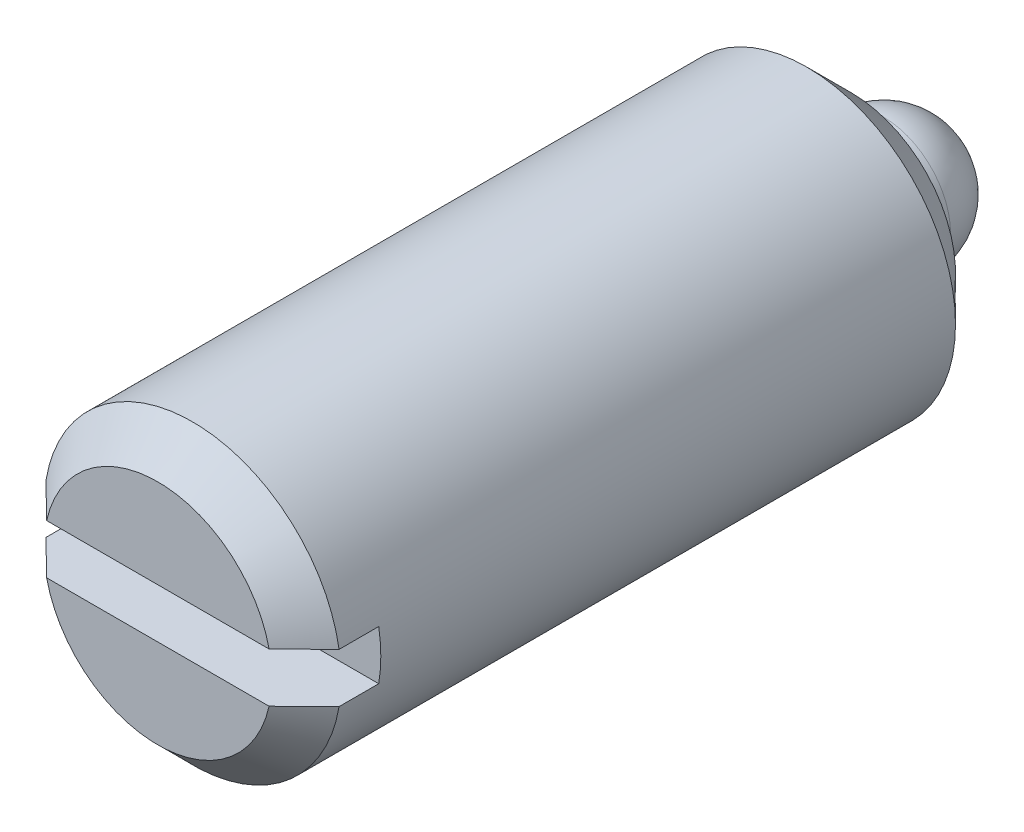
ISO-10303-21;
HEADER;
FILE_DESCRIPTION(('STEP AP214'),'2;1');
FILE_NAME('part.step','',(''),(''),'','','');
FILE_SCHEMA(('AUTOMOTIVE_DESIGN { 1 0 10303 214 1 1 1 1 }'));
ENDSEC;
DATA;
#1=APPLICATION_CONTEXT('core data for automotive mechanical design processes');
#2=APPLICATION_PROTOCOL_DEFINITION('international standard','automotive_design',2000,#1);
#3=PRODUCT_CONTEXT('',#1,'mechanical');
#4=PRODUCT('Part','Part','',(#3));
#5=PRODUCT_RELATED_PRODUCT_CATEGORY('part','',(#4));
#6=PRODUCT_DEFINITION_FORMATION('','',#4);
#7=PRODUCT_DEFINITION_CONTEXT('part definition',#1,'design');
#8=PRODUCT_DEFINITION('design','',#6,#7);
#9=PRODUCT_DEFINITION_SHAPE('','',#8);
#10=(LENGTH_UNIT() NAMED_UNIT(*) SI_UNIT(.MILLI.,.METRE.));
#11=(NAMED_UNIT(*) PLANE_ANGLE_UNIT() SI_UNIT($,.RADIAN.));
#12=(NAMED_UNIT(*) SI_UNIT($,.STERADIAN.) SOLID_ANGLE_UNIT());
#13=UNCERTAINTY_MEASURE_WITH_UNIT(LENGTH_MEASURE(1.E-05),#10,'distance_accuracy_value','');
#14=(GEOMETRIC_REPRESENTATION_CONTEXT(3) GLOBAL_UNCERTAINTY_ASSIGNED_CONTEXT((#13)) GLOBAL_UNIT_ASSIGNED_CONTEXT((#10,
#11,#12)) REPRESENTATION_CONTEXT('',''));
#15=CARTESIAN_POINT('',(0.,0.,0.));
#16=DIRECTION('',(0.,0.,1.));
#17=DIRECTION('',(1.,0.,0.));
#18=AXIS2_PLACEMENT_3D('',#15,#16,#17);
#19=CARTESIAN_POINT('',(1.95972957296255,0.500000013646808,16.));
#20=DIRECTION('',(0.,0.,-1.));
#21=DIRECTION('',(-1.,-7.49125187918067E-11,0.));
#22=AXIS2_PLACEMENT_3D('',#19,#20,#21);
#23=PLANE('',#22);
#24=DIRECTION('',(-1.,-7.49125187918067E-11,0.));
#25=VECTOR('',#24,1.);
#26=CARTESIAN_POINT('',(3.74562556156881E-11,-0.4999999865,16.));
#27=LINE('',#26,#25);
#28=CARTESIAN_POINT('',(2.2449944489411,-0.499999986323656,16.));
#29=VERTEX_POINT('',#28);
#30=CARTESIAN_POINT('',(-2.24499444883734,-0.499999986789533,16.));
#31=VERTEX_POINT('',#30);
#32=EDGE_CURVE('E116',#29,#31,#27,.T.);
#33=ORIENTED_EDGE('',*,*,#32,.T.);
#34=CARTESIAN_POINT('',(0.,0.,16.));
#35=DIRECTION('',(0.,0.,-1.));
#36=DIRECTION('',(-7.49125187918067E-11,1.,0.));
#37=AXIS2_PLACEMENT_3D('',#34,#35,#36);
#38=CIRCLE('',#37,2.30000001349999);
#39=EDGE_CURVE('E98',#29,#31,#38,.T.);
#40=ORIENTED_EDGE('',*,*,#39,.F.);
#41=EDGE_LOOP('',(#33,#40));
#42=FACE_BOUND('',#41,.T.);
#43=ADVANCED_FACE('F14',(#42),#23,.F.);
#44=DIRECTION('',(1.,7.49125187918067E-11,0.));
#45=VECTOR('',#44,1.);
#46=CARTESIAN_POINT('',(-3.74562631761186E-11,0.5000000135,16.));
#47=LINE('',#46,#45);
#48=CARTESIAN_POINT('',(-2.24499444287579,0.500000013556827,16.));
#49=VERTEX_POINT('',#48);
#50=CARTESIAN_POINT('',(2.24499444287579,0.500000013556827,16.));
#51=VERTEX_POINT('',#50);
#52=EDGE_CURVE('E91',#49,#51,#47,.T.);
#53=ORIENTED_EDGE('',*,*,#52,.T.);
#54=EDGE_CURVE('E101',#49,#51,#38,.T.);
#55=ORIENTED_EDGE('',*,*,#54,.F.);
#56=EDGE_LOOP('',(#53,#55));
#57=FACE_BOUND('',#56,.T.);
#58=ADVANCED_FACE('F138',(#57),#23,.F.);
#59=CARTESIAN_POINT('',(0.,1.35E-08,2.9));
#60=DIRECTION('',(0.,0.,1.));
#61=DIRECTION('',(-7.49125187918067E-11,1.,0.));
#62=AXIS2_PLACEMENT_3D('',#59,#60,#61);
#63=CYLINDRICAL_SURFACE('',#62,3.);
#64=CARTESIAN_POINT('',(0.,1.35E-08,2.9));
#65=DIRECTION('',(0.,0.,1.));
#66=DIRECTION('',(1.,7.49125187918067E-11,0.));
#67=AXIS2_PLACEMENT_3D('',#64,#65,#66);
#68=CIRCLE('',#67,3.);
#69=CARTESIAN_POINT('',(3.,1.37247375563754E-08,2.9));
#70=VERTEX_POINT('',#69);
#71=EDGE_CURVE('E87',#70,#70,#68,.T.);
#72=ORIENTED_EDGE('',*,*,#71,.T.);
#73=EDGE_LOOP('',(#72));
#74=FACE_BOUND('',#73,.T.);
#75=CARTESIAN_POINT('',(0.,0.,15.3));
#76=DIRECTION('',(0.,0.,-1.));
#77=DIRECTION('',(-7.49125187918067E-11,1.,0.));
#78=AXIS2_PLACEMENT_3D('',#75,#76,#77);
#79=CIRCLE('',#78,3.00000001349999);
#80=CARTESIAN_POINT('',(2.95803989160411,-0.499999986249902,15.3000000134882));
#81=VERTEX_POINT('',#80);
#82=CARTESIAN_POINT('',(-2.95803990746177,-0.499999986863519,15.3));
#83=VERTEX_POINT('',#82);
#84=EDGE_CURVE('E97',#81,#83,#79,.T.);
#85=ORIENTED_EDGE('',*,*,#84,.T.);
#86=DIRECTION('',(0.,0.,-1.));
#87=VECTOR('',#86,1.);
#88=CARTESIAN_POINT('',(-2.9580398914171,-0.499999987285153,8.95));
#89=LINE('',#88,#87);
#90=CARTESIAN_POINT('',(-2.95803989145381,-0.499999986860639,14.5));
#91=VERTEX_POINT('',#90);
#92=EDGE_CURVE('E35',#83,#91,#89,.T.);
#93=ORIENTED_EDGE('',*,*,#92,.T.);
#94=CARTESIAN_POINT('',(0.,1.34999966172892E-08,14.5));
#95=DIRECTION('',(0.,0.,1.));
#96=DIRECTION('',(7.49125187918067E-11,-1.,0.));
#97=AXIS2_PLACEMENT_3D('',#94,#95,#96);
#98=CIRCLE('',#97,2.99999999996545);
#99=CARTESIAN_POINT('',(-2.95803989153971,0.500000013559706,14.5));
#100=VERTEX_POINT('',#99);
#101=EDGE_CURVE('E85',#100,#91,#98,.T.);
#102=ORIENTED_EDGE('',*,*,#101,.F.);
#103=DIRECTION('',(0.,0.,1.));
#104=VECTOR('',#103,1.);
#105=CARTESIAN_POINT('',(-2.95803989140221,0.500000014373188,8.95));
#106=LINE('',#105,#104);
#107=CARTESIAN_POINT('',(-2.95803989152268,0.500000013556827,15.3000000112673));
#108=VERTEX_POINT('',#107);
#109=EDGE_CURVE('E78',#100,#108,#106,.T.);
#110=ORIENTED_EDGE('',*,*,#109,.T.);
#111=CARTESIAN_POINT('',(2.95803990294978,0.500000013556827,15.3));
#112=VERTEX_POINT('',#111);
#113=EDGE_CURVE('E83',#108,#112,#79,.T.);
#114=ORIENTED_EDGE('',*,*,#113,.T.);
#115=DIRECTION('',(0.,0.,-1.));
#116=VECTOR('',#115,1.);
#117=CARTESIAN_POINT('',(2.9580398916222,0.500000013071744,8.95));
#118=LINE('',#117,#116);
#119=CARTESIAN_POINT('',(2.95803989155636,0.500000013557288,14.5));
#120=VERTEX_POINT('',#119);
#121=EDGE_CURVE('E43',#112,#120,#118,.T.);
#122=ORIENTED_EDGE('',*,*,#121,.T.);
#123=CARTESIAN_POINT('',(0.,1.34999966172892E-08,14.5));
#124=DIRECTION('',(0.,0.,1.));
#125=DIRECTION('',(7.49125187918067E-11,-1.,0.));
#126=AXIS2_PLACEMENT_3D('',#123,#124,#125);
#127=CIRCLE('',#126,3.00000000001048);
#128=CARTESIAN_POINT('',(2.95803989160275,-0.499999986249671,14.5));
#129=VERTEX_POINT('',#128);
#130=EDGE_CURVE('E108',#129,#120,#127,.T.);
#131=ORIENTED_EDGE('',*,*,#130,.F.);
#132=DIRECTION('',(0.,0.,1.));
#133=VECTOR('',#132,1.);
#134=CARTESIAN_POINT('',(2.95803989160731,-0.499999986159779,8.95));
#135=LINE('',#134,#133);
#136=EDGE_CURVE('E234',#129,#81,#135,.T.);
#137=ORIENTED_EDGE('',*,*,#136,.T.);
#138=EDGE_LOOP('',(#85,#93,#102,#110,#114,#122,#131,#137));
#139=FACE_BOUND('',#138,.T.);
#140=ADVANCED_FACE('F81',(#74,#139),#63,.T.);
#141=CARTESIAN_POINT('',(0.,0.,15.3));
#142=DIRECTION('',(0.,0.,-1.));
#143=DIRECTION('',(-7.49125187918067E-11,1.,0.));
#144=AXIS2_PLACEMENT_3D('',#141,#142,#143);
#145=CONICAL_SURFACE('',#144,3.00000001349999,0.785398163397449);
#146=ORIENTED_EDGE('',*,*,#84,.F.);
#147=CARTESIAN_POINT('',(6.53264893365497,-0.499999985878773,11.748244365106));
#148=CARTESIAN_POINT('',(6.30108594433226,-0.499999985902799,11.9791261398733));
#149=CARTESIAN_POINT('',(6.06949276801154,-0.499999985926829,12.2099776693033));
#150=CARTESIAN_POINT('',(5.60619628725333,-0.4999999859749,12.6715875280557));
#151=CARTESIAN_POINT('',(5.37449297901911,-0.499999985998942,12.9023458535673));
#152=CARTESIAN_POINT('',(4.91073296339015,-0.499999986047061,13.363929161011));
#153=CARTESIAN_POINT('',(4.67867612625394,-0.499999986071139,13.594754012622));
#154=CARTESIAN_POINT('',(4.21434980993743,-0.499999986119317,14.0561728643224));
#155=CARTESIAN_POINT('',(3.98208033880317,-0.499999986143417,14.2867668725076));
#156=CARTESIAN_POINT('',(3.52760075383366,-0.499999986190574,14.7372639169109));
#157=CARTESIAN_POINT('',(3.3054064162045,-0.499999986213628,14.9571828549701));
#158=CARTESIAN_POINT('',(2.97165790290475,-0.499999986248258,15.2866230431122));
#159=CARTESIAN_POINT('',(2.86032605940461,-0.49999998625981,15.3963694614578));
#160=CARTESIAN_POINT('',(2.6374522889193,-0.499999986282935,15.6156464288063));
#161=CARTESIAN_POINT('',(2.5259103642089,-0.499999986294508,15.7251769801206));
#162=CARTESIAN_POINT('',(2.30258249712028,-0.499999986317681,15.9438654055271));
#163=CARTESIAN_POINT('',(2.19079672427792,-0.499999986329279,16.053023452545));
#164=CARTESIAN_POINT('',(1.9667486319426,-0.499999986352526,16.2708587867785));
#165=CARTESIAN_POINT('',(1.85448629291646,-0.499999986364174,16.3795360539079));
#166=CARTESIAN_POINT('',(1.6292166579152,-0.499999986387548,16.5960762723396));
#167=CARTESIAN_POINT('',(1.51620950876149,-0.499999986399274,16.7039393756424));
#168=CARTESIAN_POINT('',(1.34563480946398,-0.499999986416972,16.8645979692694));
#169=CARTESIAN_POINT('',(1.28860118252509,-0.49999998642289,16.9179597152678));
#170=CARTESIAN_POINT('',(1.17401957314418,-0.499999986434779,17.0241274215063));
#171=CARTESIAN_POINT('',(1.11647160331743,-0.499999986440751,17.076933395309));
#172=CARTESIAN_POINT('',(1.02635006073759,-0.499999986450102,17.1584187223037));
#173=CARTESIAN_POINT('',(0.994042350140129,-0.499999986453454,17.1873918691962));
#174=CARTESIAN_POINT('',(0.929117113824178,-0.49999998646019,17.2449960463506));
#175=CARTESIAN_POINT('',(0.896499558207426,-0.499999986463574,17.2736270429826));
#176=CARTESIAN_POINT('',(0.830625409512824,-0.499999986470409,17.330637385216));
#177=CARTESIAN_POINT('',(0.797365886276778,-0.49999998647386,17.3590133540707));
#178=CARTESIAN_POINT('',(0.73031497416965,-0.499999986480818,17.4151146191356));
#179=CARTESIAN_POINT('',(0.696523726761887,-0.499999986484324,17.442840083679));
#180=CARTESIAN_POINT('',(0.627916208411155,-0.499999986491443,17.4975994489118));
#181=CARTESIAN_POINT('',(0.593093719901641,-0.499999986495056,17.5246256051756));
#182=CARTESIAN_POINT('',(0.522400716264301,-0.49999998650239,17.5772663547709));
#183=CARTESIAN_POINT('',(0.486530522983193,-0.499999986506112,17.6028813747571));
#184=CARTESIAN_POINT('',(0.413497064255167,-0.49999998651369,17.6517378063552));
#185=CARTESIAN_POINT('',(0.376342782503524,-0.499999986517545,17.6749924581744));
#186=CARTESIAN_POINT('',(0.299982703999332,-0.499999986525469,17.717772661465));
#187=CARTESIAN_POINT('',(0.260782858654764,-0.499999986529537,17.7373083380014));
#188=CARTESIAN_POINT('',(0.189769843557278,-0.499999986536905,17.7659199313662));
#189=CARTESIAN_POINT('',(0.158539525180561,-0.499999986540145,17.7763885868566));
#190=CARTESIAN_POINT('',(0.0948435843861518,-0.499999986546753,17.7920093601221));
#191=CARTESIAN_POINT('',(0.0623842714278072,-0.499999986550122,17.7971855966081));
#192=CARTESIAN_POINT('',(-0.00323632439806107,-0.49999998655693,17.8010667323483));
#193=CARTESIAN_POINT('',(-0.0364012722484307,-0.499999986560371,17.7997142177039));
#194=CARTESIAN_POINT('',(-0.101929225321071,-0.49999998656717,17.7907635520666));
#195=CARTESIAN_POINT('',(-0.134289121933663,-0.499999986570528,17.7831441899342));
#196=CARTESIAN_POINT('',(-0.190075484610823,-0.499999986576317,17.7655872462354));
#197=CARTESIAN_POINT('',(-0.213823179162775,-0.49999998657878,17.7566067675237));
#198=CARTESIAN_POINT('',(-0.260461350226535,-0.49999998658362,17.7366205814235));
#199=CARTESIAN_POINT('',(-0.283351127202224,-0.499999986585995,17.7256132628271));
#200=CARTESIAN_POINT('',(-0.328455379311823,-0.499999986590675,17.7020783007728));
#201=CARTESIAN_POINT('',(-0.350666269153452,-0.499999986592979,17.6895439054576));
#202=CARTESIAN_POINT('',(-0.394423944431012,-0.499999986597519,17.6633958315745));
#203=CARTESIAN_POINT('',(-0.415971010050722,-0.499999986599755,17.6497826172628));
#204=CARTESIAN_POINT('',(-0.488153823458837,-0.499999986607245,17.6022845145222));
#205=CARTESIAN_POINT('',(-0.53755901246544,-0.499999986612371,17.5665427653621));
#206=CARTESIAN_POINT('',(-0.634587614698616,-0.499999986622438,17.4927017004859));
#207=CARTESIAN_POINT('',(-0.682209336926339,-0.49999998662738,17.454600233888));
#208=CARTESIAN_POINT('',(-0.776411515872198,-0.499999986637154,17.3769047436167));
#209=CARTESIAN_POINT('',(-0.822989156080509,-0.499999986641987,17.3373073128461));
#210=CARTESIAN_POINT('',(-0.91535161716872,-0.49999998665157,17.2572429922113));
#211=CARTESIAN_POINT('',(-0.961136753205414,-0.499999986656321,17.2167764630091));
#212=CARTESIAN_POINT('',(-1.05225586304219,-0.499999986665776,17.1351688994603));
#213=CARTESIAN_POINT('',(-1.09758882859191,-0.499999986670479,17.0940267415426));
#214=CARTESIAN_POINT('',(-1.18787010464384,-0.499999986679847,17.0113144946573));
#215=CARTESIAN_POINT('',(-1.23281837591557,-0.499999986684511,16.9697443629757));
#216=CARTESIAN_POINT('',(-1.36709768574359,-0.499999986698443,16.8447060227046));
#217=CARTESIAN_POINT('',(-1.45600407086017,-0.499999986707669,16.7607822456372));
#218=CARTESIAN_POINT('',(-1.63233912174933,-0.499999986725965,16.5930102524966));
#219=CARTESIAN_POINT('',(-1.71977386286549,-0.499999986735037,16.5091683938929));
#220=CARTESIAN_POINT('',(-1.89421652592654,-0.499999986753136,16.3410414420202));
#221=CARTESIAN_POINT('',(-1.98122444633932,-0.499999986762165,16.2567563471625));
#222=CARTESIAN_POINT('',(-2.24182852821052,-0.499999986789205,16.0034584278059));
#223=CARTESIAN_POINT('',(-2.41499931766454,-0.499999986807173,15.8340084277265));
#224=CARTESIAN_POINT('',(-2.76086331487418,-0.499999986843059,15.4944117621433));
#225=CARTESIAN_POINT('',(-2.93355616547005,-0.499999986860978,15.3242647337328));
#226=CARTESIAN_POINT('',(-3.27858845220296,-0.499999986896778,14.9836179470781));
#227=CARTESIAN_POINT('',(-3.45092789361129,-0.49999998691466,14.8131181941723));
#228=CARTESIAN_POINT('',(-3.79498738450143,-0.499999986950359,14.4722876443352));
#229=CARTESIAN_POINT('',(-3.96670794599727,-0.499999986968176,14.3019573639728));
#230=CARTESIAN_POINT('',(-4.30999889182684,-0.499999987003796,13.9611441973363));
#231=CARTESIAN_POINT('',(-4.48156927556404,-0.499999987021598,13.7906613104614));
#232=CARTESIAN_POINT('',(-4.99607037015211,-0.499999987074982,13.2791078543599));
#233=CARTESIAN_POINT('',(-5.33884431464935,-0.499999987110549,12.9378796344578));
#234=CARTESIAN_POINT('',(-5.82334929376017,-0.49999998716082,12.4552372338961));
#235=CARTESIAN_POINT('',(-5.96517482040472,-0.499999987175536,12.3139178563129));
#236=CARTESIAN_POINT('',(-6.24888769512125,-0.499999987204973,12.0311516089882));
#237=CARTESIAN_POINT('',(-6.39077502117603,-0.499999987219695,11.8897047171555));
#238=CARTESIAN_POINT('',(-6.53264893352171,-0.499999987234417,11.7482443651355));
#239=B_SPLINE_CURVE_WITH_KNOTS('',3,(#147,#148,#149,#150,#151,#152,#153,#154,#155,#156,#157,
#158,#159,#160,#161,#162,#163,#164,#165,#166,#167,#168,#169,#170,#171,#172,#173,#174,#175,#176,
#177,#178,#179,#180,#181,#182,#183,#184,#185,#186,#187,#188,#189,#190,#191,#192,#193,#194,#195,
#196,#197,#198,#199,#200,#201,#202,#203,#204,#205,#206,#207,#208,#209,#210,#211,#212,#213,#214,
#215,#216,#217,#218,#219,#220,#221,#222,#223,#224,#225,#226,#227,#228,#229,#230,#231,#232,#233,
#234,#235,#236,#237,#238),.UNSPECIFIED.,.F.,.F.,(4,2,2,2,2,2,2,2,2,2,2,2,2,2,2,2,2,2,2,2,2,2,2,
2,2,2,2,2,2,2,2,2,2,2,2,2,2,2,2,2,2,2,2,2,2,4),(0.,0.980994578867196,1.96202586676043,
2.94394958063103,3.92583755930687,4.86371310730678,5.33270277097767,5.80168738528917,
6.27041203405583,6.73915608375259,7.20781034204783,7.44212171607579,7.6764273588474,
7.80661422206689,7.93681377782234,8.06796649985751,8.19908490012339,8.3313023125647,
8.46347952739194,8.59486874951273,8.72589497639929,8.82438544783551,8.92242504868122,
9.0213283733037,9.12056783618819,9.19662857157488,9.2727500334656,9.34922118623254,
9.42565960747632,9.60842859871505,9.79136670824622,9.97475008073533,10.1580587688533,
10.3417115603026,10.5253828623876,10.8921553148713,11.2555661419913,11.6189782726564,
12.3458261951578,13.073118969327,13.8004008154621,14.5260061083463,15.2516142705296,
16.7026054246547,17.3032474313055,17.9042907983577),.UNSPECIFIED.);
#240=EDGE_CURVE('E9',#81,#29,#239,.T.);
#241=ORIENTED_EDGE('',*,*,#240,.T.);
#242=ORIENTED_EDGE('',*,*,#39,.T.);
#243=EDGE_CURVE('E18',#31,#83,#239,.T.);
#244=ORIENTED_EDGE('',*,*,#243,.T.);
#245=EDGE_LOOP('',(#146,#241,#242,#244));
#246=FACE_BOUND('',#245,.T.);
#247=ADVANCED_FACE('F137',(#246),#145,.T.);
#248=ORIENTED_EDGE('',*,*,#113,.F.);
#249=CARTESIAN_POINT('',(-6.53264893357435,0.500000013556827,11.7482443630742));
#250=CARTESIAN_POINT('',(-6.30108594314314,0.500000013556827,11.9791261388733));
#251=CARTESIAN_POINT('',(-6.06949276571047,0.500000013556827,12.2099776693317));
#252=CARTESIAN_POINT('',(-5.60619628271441,0.500000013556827,12.6715875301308));
#253=CARTESIAN_POINT('',(-5.3744929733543,0.500000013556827,12.9023458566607));
#254=CARTESIAN_POINT('',(-4.91073295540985,0.500000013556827,13.3639291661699));
#255=CARTESIAN_POINT('',(-4.678676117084,0.500000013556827,13.594754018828));
#256=CARTESIAN_POINT('',(-4.21434979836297,0.500000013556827,14.0561728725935));
#257=CARTESIAN_POINT('',(-3.98208032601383,0.500000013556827,14.2867668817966));
#258=CARTESIAN_POINT('',(-3.52760074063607,0.500000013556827,14.7372639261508));
#259=CARTESIAN_POINT('',(-3.30540640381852,0.500000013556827,14.9571828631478));
#260=CARTESIAN_POINT('',(-2.97165789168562,0.500000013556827,15.2866230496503));
#261=CARTESIAN_POINT('',(-2.86032604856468,0.500000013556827,15.3963694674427));
#262=CARTESIAN_POINT('',(-2.63745227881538,0.500000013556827,15.6156464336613));
#263=CARTESIAN_POINT('',(-2.52591035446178,0.500000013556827,15.725176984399));
#264=CARTESIAN_POINT('',(-2.30258248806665,0.500000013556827,15.943865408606));
#265=CARTESIAN_POINT('',(-2.19079671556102,0.500000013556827,16.0530234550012));
#266=CARTESIAN_POINT('',(-1.96674862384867,0.500000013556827,16.2708587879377));
#267=CARTESIAN_POINT('',(-1.85448628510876,0.500000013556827,16.3795360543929));
#268=CARTESIAN_POINT('',(-1.62921665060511,0.500000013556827,16.5960762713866));
#269=CARTESIAN_POINT('',(-1.51620950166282,0.500000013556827,16.7039393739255));
#270=CARTESIAN_POINT('',(-1.34563480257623,0.500000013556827,16.8645979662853));
#271=CARTESIAN_POINT('',(-1.28860117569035,0.500000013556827,16.9179597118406));
#272=CARTESIAN_POINT('',(-1.17401956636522,0.500000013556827,17.0241274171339));
#273=CARTESIAN_POINT('',(-1.11647159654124,0.500000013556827,17.0769333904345));
#274=CARTESIAN_POINT('',(-1.02635005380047,0.500000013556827,17.1584187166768));
#275=CARTESIAN_POINT('',(-0.99404234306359,0.500000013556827,17.1873918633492));
#276=CARTESIAN_POINT('',(-0.929117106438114,0.500000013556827,17.2449960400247));
#277=CARTESIAN_POINT('',(-0.896499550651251,0.500000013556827,17.273627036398));
#278=CARTESIAN_POINT('',(-0.830625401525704,0.500000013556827,17.3306373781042));
#279=CARTESIAN_POINT('',(-0.797365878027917,0.500000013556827,17.3590133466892));
#280=CARTESIAN_POINT('',(-0.730314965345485,0.500000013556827,17.4151146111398));
#281=CARTESIAN_POINT('',(-0.696523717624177,0.500000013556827,17.4428400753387));
#282=CARTESIAN_POINT('',(-0.627916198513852,0.500000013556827,17.4975994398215));
#283=CARTESIAN_POINT('',(-0.593093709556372,0.500000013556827,17.5246255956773));
#284=CARTESIAN_POINT('',(-0.522400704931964,0.500000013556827,17.5772663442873));
#285=CARTESIAN_POINT('',(-0.486530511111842,0.500000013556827,17.6028813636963));
#286=CARTESIAN_POINT('',(-0.413497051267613,0.500000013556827,17.6517377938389));
#287=CARTESIAN_POINT('',(-0.376342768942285,0.500000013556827,17.6749924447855));
#288=CARTESIAN_POINT('',(-0.299982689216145,0.500000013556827,17.7177726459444));
#289=CARTESIAN_POINT('',(-0.260782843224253,0.500000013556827,17.7373083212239));
#290=CARTESIAN_POINT('',(-0.189769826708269,0.500000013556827,17.7659199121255));
#291=CARTESIAN_POINT('',(-0.158539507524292,0.500000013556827,17.7763885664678));
#292=CARTESIAN_POINT('',(-0.0948435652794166,0.500000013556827,17.7920093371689));
#293=CARTESIAN_POINT('',(-0.0623842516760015,0.500000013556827,17.7971855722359));
#294=CARTESIAN_POINT('',(0.00323634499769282,0.500000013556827,17.8010667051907));
#295=CARTESIAN_POINT('',(0.0364012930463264,0.500000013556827,17.7997141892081));
#296=CARTESIAN_POINT('',(0.101929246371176,0.500000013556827,17.7907635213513));
#297=CARTESIAN_POINT('',(0.134289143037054,0.500000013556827,17.7831441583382));
#298=CARTESIAN_POINT('',(0.190075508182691,0.500000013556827,17.765587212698));
#299=CARTESIAN_POINT('',(0.213823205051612,0.500000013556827,17.7566067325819));
#300=CARTESIAN_POINT('',(0.260461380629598,0.500000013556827,17.7366205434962));
#301=CARTESIAN_POINT('',(0.283351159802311,0.500000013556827,17.7256132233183));
#302=CARTESIAN_POINT('',(0.328455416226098,0.500000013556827,17.7020782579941));
#303=CARTESIAN_POINT('',(0.350666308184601,0.500000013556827,17.6895438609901));
#304=CARTESIAN_POINT('',(0.394423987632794,0.500000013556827,17.6633957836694));
#305=CARTESIAN_POINT('',(0.415971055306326,0.500000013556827,17.6497825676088));
#306=CARTESIAN_POINT('',(0.488153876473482,0.500000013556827,17.602284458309));
#307=CARTESIAN_POINT('',(0.537559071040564,0.500000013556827,17.5665427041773));
#308=CARTESIAN_POINT('',(0.63458768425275,0.500000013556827,17.4927016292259));
#309=CARTESIAN_POINT('',(0.682209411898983,0.500000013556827,17.4546001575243));
#310=CARTESIAN_POINT('',(0.776411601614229,0.500000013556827,17.3769046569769));
#311=CARTESIAN_POINT('',(0.82298924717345,0.500000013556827,17.3373072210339));
#312=CARTESIAN_POINT('',(0.915351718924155,0.500000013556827,17.257242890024));
#313=CARTESIAN_POINT('',(0.961136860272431,0.500000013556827,17.216776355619));
#314=CARTESIAN_POINT('',(1.05225598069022,0.500000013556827,17.1351687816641));
#315=CARTESIAN_POINT('',(1.09758895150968,0.500000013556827,17.0940266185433));
#316=CARTESIAN_POINT('',(1.18787023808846,0.500000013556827,17.0113143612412));
#317=CARTESIAN_POINT('',(1.2328185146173,0.500000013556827,16.969744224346));
#318=CARTESIAN_POINT('',(1.36709784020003,0.500000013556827,16.8447058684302));
#319=CARTESIAN_POINT('',(1.45600423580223,0.500000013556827,16.7607820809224));
#320=CARTESIAN_POINT('',(1.632339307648,0.500000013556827,16.593010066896));
#321=CARTESIAN_POINT('',(1.71977405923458,0.500000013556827,16.5091681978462));
#322=CARTESIAN_POINT('',(1.89421674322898,0.500000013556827,16.3410412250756));
#323=CARTESIAN_POINT('',(1.98122467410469,0.500000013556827,16.2567561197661));
#324=CARTESIAN_POINT('',(2.24182878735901,0.500000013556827,16.0034581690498));
#325=CARTESIAN_POINT('',(2.41499959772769,0.500000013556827,15.8340081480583));
#326=CARTESIAN_POINT('',(2.76086363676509,0.500000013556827,15.4944114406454));
#327=CARTESIAN_POINT('',(2.93355650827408,0.500000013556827,15.3242643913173));
#328=CARTESIAN_POINT('',(3.27858883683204,0.500000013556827,14.9836175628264));
#329=CARTESIAN_POINT('',(3.4509282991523,0.500000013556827,14.8131177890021));
#330=CARTESIAN_POINT('',(3.79498783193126,0.500000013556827,14.4722871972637));
#331=CARTESIAN_POINT('',(3.96670841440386,0.500000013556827,14.3019568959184));
#332=CARTESIAN_POINT('',(4.30999940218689,0.500000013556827,13.9611436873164));
#333=CARTESIAN_POINT('',(4.48156980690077,0.500000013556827,13.7906607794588));
#334=CARTESIAN_POINT('',(4.99607096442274,0.500000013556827,13.2791072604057));
#335=CARTESIAN_POINT('',(5.33884495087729,0.500000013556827,12.9378789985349));
#336=CARTESIAN_POINT('',(5.82334985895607,0.500000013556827,12.4552366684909));
#337=CARTESIAN_POINT('',(5.96517527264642,0.500000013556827,12.3139174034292));
#338=CARTESIAN_POINT('',(6.24888792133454,0.500000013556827,12.0311513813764));
#339=CARTESIAN_POINT('',(6.39077513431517,0.500000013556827,11.8897046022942));
#340=CARTESIAN_POINT('',(6.53264893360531,0.500000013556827,11.7482443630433));
#341=B_SPLINE_CURVE_WITH_KNOTS('',3,(#249,#250,#251,#252,#253,#254,#255,#256,#257,#258,#259,
#260,#261,#262,#263,#264,#265,#266,#267,#268,#269,#270,#271,#272,#273,#274,#275,#276,#277,#278,
#279,#280,#281,#282,#283,#284,#285,#286,#287,#288,#289,#290,#291,#292,#293,#294,#295,#296,#297,
#298,#299,#300,#301,#302,#303,#304,#305,#306,#307,#308,#309,#310,#311,#312,#313,#314,#315,#316,
#317,#318,#319,#320,#321,#322,#323,#324,#325,#326,#327,#328,#329,#330,#331,#332,#333,#334,#335,
#336,#337,#338,#339,#340),.UNSPECIFIED.,.F.,.F.,(4,2,2,2,2,2,2,2,2,2,2,2,2,2,2,2,2,2,2,2,2,2,2,
2,2,2,2,2,2,2,2,2,2,2,2,2,2,2,2,2,2,2,2,2,2,4),(0.,0.98099458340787,1.96202587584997,
2.9439495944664,3.9258375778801,4.86371312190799,5.33270278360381,5.8016873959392,
6.27041204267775,6.73915609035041,7.20781034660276,7.44212171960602,7.67642736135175,
7.80661422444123,7.93681378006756,8.06796650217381,8.19908490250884,8.3313023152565,
8.46347953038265,8.59486875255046,8.72589497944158,8.82438545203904,8.92242505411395,
9.02132837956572,9.12056784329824,9.19662858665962,9.27275005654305,9.34922121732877,
9.42565964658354,9.60842866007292,9.79136679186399,9.97475018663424,10.1580588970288,
10.3417117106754,10.5253830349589,10.8921555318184,11.2555664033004,11.6189785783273,
12.3458265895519,13.073119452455,13.8004013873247,14.5260067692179,15.2516150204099,
16.7026063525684,17.3032478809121,17.9042907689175),.UNSPECIFIED.);
#342=EDGE_CURVE('E90',#108,#49,#341,.T.);
#343=ORIENTED_EDGE('',*,*,#342,.T.);
#344=ORIENTED_EDGE('',*,*,#54,.T.);
#345=EDGE_CURVE('E95',#51,#112,#341,.T.);
#346=ORIENTED_EDGE('',*,*,#345,.T.);
#347=EDGE_LOOP('',(#248,#343,#344,#346));
#348=FACE_BOUND('',#347,.T.);
#349=ADVANCED_FACE('F96',(#348),#145,.T.);
#350=CARTESIAN_POINT('',(0.,1.35E-08,1.35));
#351=DIRECTION('',(0.,0.,1.));
#352=DIRECTION('',(-7.49125187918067E-11,1.,0.));
#353=AXIS2_PLACEMENT_3D('',#350,#351,#352);
#354=SPHERICAL_SURFACE('',#353,1.35);
#355=CARTESIAN_POINT('',(0.,0.,0.));
#356=VERTEX_POINT('',#355);
#357=VERTEX_LOOP('',#356);
#358=FACE_BOUND('',#357,.T.);
#359=CARTESIAN_POINT('',(0.,1.35E-08,1.35));
#360=DIRECTION('',(0.,0.,1.));
#361=DIRECTION('',(1.,7.49125187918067E-11,0.));
#362=AXIS2_PLACEMENT_3D('',#359,#360,#361);
#363=CIRCLE('',#362,1.35);
#364=CARTESIAN_POINT('',(1.35,1.36011319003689E-08,1.35));
#365=VERTEX_POINT('',#364);
#366=EDGE_CURVE('E113',#365,#365,#363,.T.);
#367=ORIENTED_EDGE('',*,*,#366,.F.);
#368=EDGE_LOOP('',(#367));
#369=FACE_BOUND('',#368,.T.);
#370=ADVANCED_FACE('F119',(#358,#369),#354,.T.);
#371=CARTESIAN_POINT('',(0.,1.35E-08,1.35));
#372=DIRECTION('',(0.,0.,1.));
#373=DIRECTION('',(1.,7.49125187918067E-11,0.));
#374=AXIS2_PLACEMENT_3D('',#371,#372,#373);
#375=CYLINDRICAL_SURFACE('',#374,1.35);
#376=CARTESIAN_POINT('',(0.,1.35E-08,2.));
#377=DIRECTION('',(0.,0.,1.));
#378=DIRECTION('',(1.,7.49125187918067E-11,0.));
#379=AXIS2_PLACEMENT_3D('',#376,#377,#378);
#380=CIRCLE('',#379,1.35);
#381=CARTESIAN_POINT('',(1.35,1.36011319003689E-08,2.));
#382=VERTEX_POINT('',#381);
#383=EDGE_CURVE('E243',#382,#382,#380,.F.);
#384=ORIENTED_EDGE('',*,*,#383,.T.);
#385=EDGE_LOOP('',(#384));
#386=FACE_BOUND('',#385,.T.);
#387=ORIENTED_EDGE('',*,*,#366,.T.);
#388=EDGE_LOOP('',(#387));
#389=FACE_BOUND('',#388,.T.);
#390=ADVANCED_FACE('F123',(#386,#389),#375,.T.);
#391=CARTESIAN_POINT('',(-2.12519999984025,-2.13251273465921,2.));
#392=DIRECTION('',(0.,0.,1.));
#393=DIRECTION('',(1.,7.49125187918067E-11,0.));
#394=AXIS2_PLACEMENT_3D('',#391,#392,#393);
#395=PLANE('',#394);
#396=ORIENTED_EDGE('',*,*,#383,.F.);
#397=EDGE_LOOP('',(#396));
#398=FACE_BOUND('',#397,.T.);
#399=CARTESIAN_POINT('',(0.,1.35E-08,2.));
#400=DIRECTION('',(0.,0.,1.));
#401=DIRECTION('',(-7.49125187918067E-11,1.,0.));
#402=AXIS2_PLACEMENT_3D('',#399,#400,#401);
#403=CIRCLE('',#402,2.1);
#404=CARTESIAN_POINT('',(-1.57316293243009E-10,2.1000000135,2.));
#405=VERTEX_POINT('',#404);
#406=EDGE_CURVE('E235',#405,#405,#403,.T.);
#407=ORIENTED_EDGE('',*,*,#406,.F.);
#408=EDGE_LOOP('',(#407));
#409=FACE_BOUND('',#408,.T.);
#410=ADVANCED_FACE('F128',(#398,#409),#395,.F.);
#411=CARTESIAN_POINT('',(2.95803989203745,-0.499999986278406,16.));
#412=DIRECTION('',(7.49125187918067E-11,-1.,0.));
#413=DIRECTION('',(-1.,-7.49125187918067E-11,0.));
#414=AXIS2_PLACEMENT_3D('',#411,#412,#413);
#415=PLANE('',#414);
#416=ORIENTED_EDGE('',*,*,#92,.F.);
#417=ORIENTED_EDGE('',*,*,#243,.F.);
#418=ORIENTED_EDGE('',*,*,#32,.F.);
#419=ORIENTED_EDGE('',*,*,#240,.F.);
#420=ORIENTED_EDGE('',*,*,#136,.F.);
#421=DIRECTION('',(1.,1.03428374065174E-10,0.));
#422=VECTOR('',#421,1.);
#423=CARTESIAN_POINT('',(-2.95803989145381,-0.499999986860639,14.5));
#424=LINE('',#423,#422);
#425=EDGE_CURVE('E105',#91,#129,#424,.T.);
#426=ORIENTED_EDGE('',*,*,#425,.F.);
#427=EDGE_LOOP('',(#416,#417,#418,#419,#420,#426));
#428=FACE_BOUND('',#427,.T.);
#429=ADVANCED_FACE('F133',(#428),#415,.F.);
#430=CARTESIAN_POINT('',(0.,1.35E-08,2.));
#431=DIRECTION('',(0.,0.,1.));
#432=DIRECTION('',(-7.49125187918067E-11,1.,0.));
#433=AXIS2_PLACEMENT_3D('',#430,#431,#432);
#434=CONICAL_SURFACE('',#433,2.1,0.785398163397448);
#435=ORIENTED_EDGE('',*,*,#71,.F.);
#436=EDGE_LOOP('',(#435));
#437=FACE_BOUND('',#436,.T.);
#438=ORIENTED_EDGE('',*,*,#406,.T.);
#439=EDGE_LOOP('',(#438));
#440=FACE_BOUND('',#439,.T.);
#441=ADVANCED_FACE('F130',(#437,#440),#434,.T.);
#442=CARTESIAN_POINT('',(-2.95803989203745,0.500000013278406,16.));
#443=DIRECTION('',(-7.49125187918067E-11,1.,0.));
#444=DIRECTION('',(1.,7.49125187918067E-11,0.));
#445=AXIS2_PLACEMENT_3D('',#442,#443,#444);
#446=PLANE('',#445);
#447=ORIENTED_EDGE('',*,*,#52,.F.);
#448=ORIENTED_EDGE('',*,*,#342,.F.);
#449=ORIENTED_EDGE('',*,*,#109,.F.);
#450=DIRECTION('',(-1.,-5.64577387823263E-13,0.));
#451=VECTOR('',#450,1.);
#452=CARTESIAN_POINT('',(2.95803989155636,0.500000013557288,14.5));
#453=LINE('',#452,#451);
#454=EDGE_CURVE('E111',#120,#100,#453,.T.);
#455=ORIENTED_EDGE('',*,*,#454,.F.);
#456=ORIENTED_EDGE('',*,*,#121,.F.);
#457=ORIENTED_EDGE('',*,*,#345,.F.);
#458=EDGE_LOOP('',(#447,#448,#449,#455,#456,#457));
#459=FACE_BOUND('',#458,.T.);
#460=ADVANCED_FACE('F16',(#459),#446,.F.);
#461=CARTESIAN_POINT('',(0.,1.34999966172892E-08,14.5));
#462=DIRECTION('',(0.,0.,1.));
#463=DIRECTION('',(7.49125187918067E-11,-1.,0.));
#464=AXIS2_PLACEMENT_3D('',#461,#462,#463);
#465=PLANE('',#464);
#466=ORIENTED_EDGE('',*,*,#101,.T.);
#467=ORIENTED_EDGE('',*,*,#425,.T.);
#468=ORIENTED_EDGE('',*,*,#130,.T.);
#469=ORIENTED_EDGE('',*,*,#454,.T.);
#470=EDGE_LOOP('',(#466,#467,#468,#469));
#471=FACE_BOUND('',#470,.T.);
#472=ADVANCED_FACE('F125',(#471),#465,.T.);
#473=CLOSED_SHELL('',(#43,#58,#140,#247,#349,#370,#390,#410,#429,#441,#460,#472));
#474=MANIFOLD_SOLID_BREP('B1',#473);
#475=ADVANCED_BREP_SHAPE_REPRESENTATION('',(#18,#474),#14);
#476=SHAPE_DEFINITION_REPRESENTATION(#9,#475);
ENDSEC;
END-ISO-10303-21;
